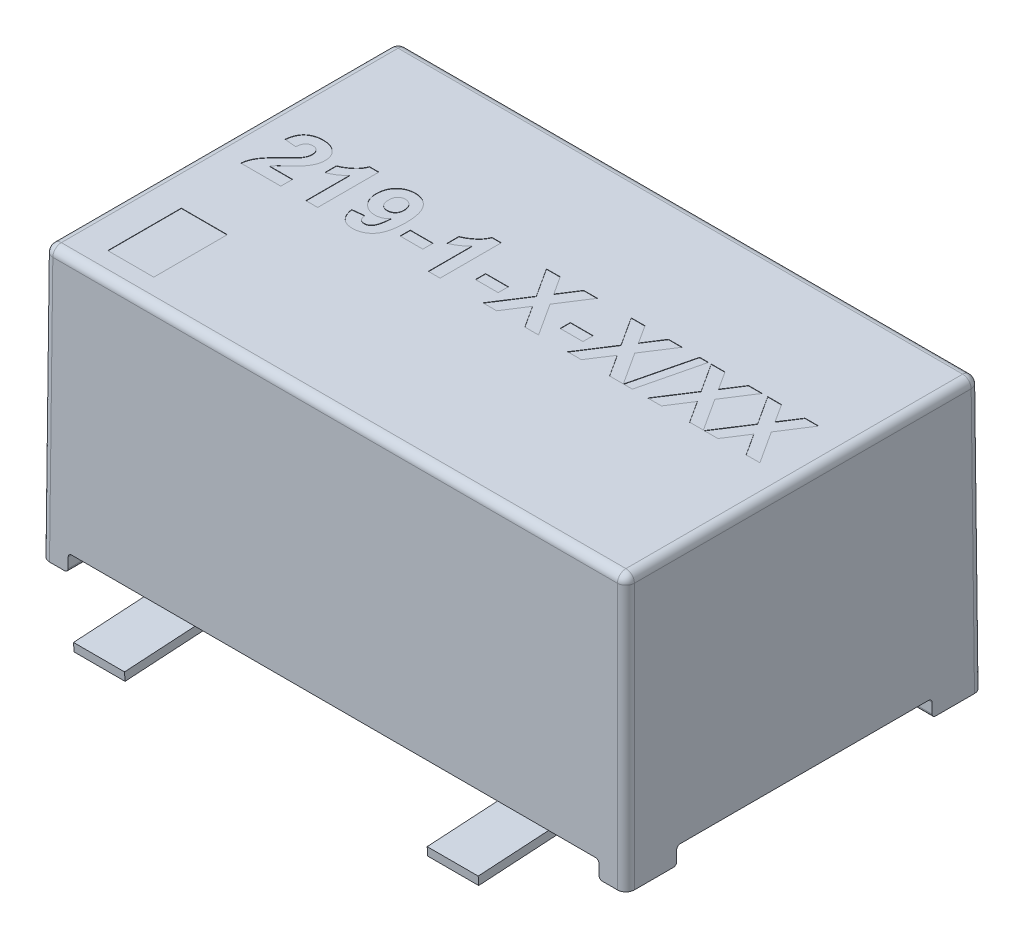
from build123d import *

# Parameters (mm, degrees)
SKETCH1_W                         = 17.2
SKETCH1_H                         = 10.5
MAIN_BODY_DEPTH                   = 7.51
STAND_OFF_FOOT_DEPTH              = 0.5
STAND_OFF_MIRROR2_COPY_1_DEPTH    = 0.5
F_0_36DEG_DRAFT_ANGLE             = -0.36
F_0_25MM_FILLET1_R                = 0.25
F_0_36_INNER_WALL_DRAFT_ANGLE     = 0.36
F_0_36_STAND_OFF_FOOT_DRAFT_ANGLE = 0.36
F_0_20MM_FILLET1_R                = 0.1
SKETCH8_W                         = 1.5
SKETCH8_H                         = 0.25
LPATTERN1_COUNT                   = 2
LPATTERN1_PITCH                   = 4.7
MIRROR2_COPY_1_SKETCH_W           = 1.5
MIRROR2_COPY_1_SKETCH_H           = 0.25
SKETCH9_W                         = 1.5
SKETCH9_H                         = 0.25
SKETCH10_W                        = 1.352618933
SKETCH10_H                        = 2.164190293
SKETCH10_W_2                      = 0.669230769
SKETCH10_H_2                      = 0.3
SKETCH10_W_3                      = 0.66923077
TEXT_2_DEPTH                      = 0.01
SKETCH11_W                        = 1.5
SKETCH11_H                        = 2.987296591
SW2_PINS_REMOVED_DEPTH            = 10


with BuildPart() as part:
    # Sketch1 → Main Body (new body)
    with BuildSketch(Plane(origin=(0, 0, 0), x_dir=(1, 0, 0), z_dir=(0, 1, 0))):
        Rectangle(SKETCH1_W, SKETCH1_H)
    extrude(amount=-MAIN_BODY_DEPTH)

    # Sketch2 → Stand off foot (add)
    with BuildSketch(Plane(origin=(0, -7.51, 0), x_dir=(-1, 0, 0), z_dir=(0, -1, 0))):
        Polygon((-8.6, 5.25), (-7.8, 5.25), (-7.8, 4.75), (-8.1, 4.75), (-8.1, 3.75), (-8.6, 3.75), align=None)
    stand_off_foot = extrude(amount=STAND_OFF_FOOT_DEPTH)

    # Stand off Mirror1: Stand off foot across plane
    add(stand_off_foot.mirror(Plane(origin=(0, 0, 0), x_dir=(0, 0, 1), z_dir=(1, 0, 0))))

    # Stand off Mirror2: Stand off foot across plane
    add(stand_off_foot.mirror(Plane.XY))

    # Stand off Mirror2 copy 1 sketch → Stand off Mirror2 copy 1 (add)
    with BuildSketch(Plane.XZ.offset(7.51)):
        Polygon((-8.6, 5.25), (-7.8, 5.25), (-7.8, 4.75), (-8.1, 4.75), (-8.1, 3.75), (-8.6, 3.75), align=None)
    extrude(amount=STAND_OFF_MIRROR2_COPY_1_DEPTH)

    # 0.36deg Draft
    f_0_36deg_draft_faces = [part.faces().sort_by_distance(p)[0] for p in [
        (-7.8, -7.76, -5),
        (-8.35, -7.76, -3.75),
        (8.35, -7.76, -3.75),
        (7.8, -7.76, -5),
        (8.35, -7.76, 3.75),
        (7.8, -7.76, 5),
        (-8.35, -7.76, 3.75),
        (-7.8, -7.76, 5),
        (-8.6, -3.829761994, 0),
        (0, -3.779651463, 5.25),
        (8.6, -3.829761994, 0),
        (0, -3.779651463, -5.25),
    ]]
    draft(f_0_36deg_draft_faces, Plane(origin=(0, -8.01, 0), x_dir=(0, 0, -1), z_dir=(0, -1, 0)), F_0_36DEG_DRAFT_ANGLE)

    # 0.25mm Fillet1
    f_0_25mm_fillet1_edges = [part.edges().sort_by_distance(p)[0] for p in [
        (0, 0, 5.199671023),
        (-8.549671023, 0, 0),
        (0, 0, -5.199671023),
        (8.549671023, 0, 0),
        (8.574835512, -4.005, 5.224835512),
        (-8.574835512, -4.005, 5.224835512),
        (-8.574835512, -4.005, -5.224835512),
        (8.574835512, -4.005, -5.224835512),
    ]]
    fillet(f_0_25mm_fillet1_edges, radius=F_0_25MM_FILLET1_R)

    # 0.36 Inner Wall Draft
    f_0_36_inner_wall_draft_faces = [part.faces().sort_by_distance(p)[0] for p in [
        (-8.1, -7.760131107, -4.250784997),
        (7.95078403, -7.760438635, -4.75),
        (8.1, -7.760131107, -4.250784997),
        (-7.95078403, -7.760438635, 4.75),
    ]]
    draft(f_0_36_inner_wall_draft_faces, Plane(origin=(0, -7.51, 0), x_dir=(0, 0, -1), z_dir=(0, -1, 0)), F_0_36_INNER_WALL_DRAFT_ANGLE)

    # 0.36 Stand off Foot Draft
    f_0_36_stand_off_foot_draft_faces = [part.faces().sort_by_distance(p)[0] for p in [
        (8.349215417, -7.760262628, 3.751569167),
        (8.35, -7.76, -3.751570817),
        (-8.35, -7.76, -3.751570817),
        (-8.349215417, -7.760262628, 3.751569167),
        (-7.801569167, -7.760262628, -4.999215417),
        (-7.801570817, -7.76, 5),
        (7.801570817, -7.76, -5),
        (7.801569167, -7.760262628, 4.999215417),
    ]]
    draft(f_0_36_stand_off_foot_draft_faces, Plane(origin=(0, -7.51, 0), x_dir=(0, 0, -1), z_dir=(0, -1, 0)), F_0_36_STAND_OFF_FOOT_DRAFT_ANGLE)

    # 0.20mm Fillet1
    f_0_20mm_fillet1_edges = [part.edges().sort_by_distance(p)[0] for p in [
        (8.348429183, -7.51, -3.753141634),
        (7.803141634, -7.51, -4.998429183),
        (8.351570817, -8.01, -3.756283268),
        (7.806283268, -8.01, -5.001570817),
        (-7.806283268, -8.01, -5),
        (-8.351570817, -8.01, -3.756283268),
        (-8.348429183, -7.51, -3.753141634),
        (-7.803141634, -7.51, -4.998429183),
        (-8.348429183, -7.51, 3.753141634),
        (-7.803141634, -7.51, 4.998429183),
        (-8.35, -8.01, 3.756283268),
        (-7.806283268, -8.01, 5.001570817),
        (7.806283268, -8.01, 5),
        (8.35, -8.01, 3.756283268),
        (8.348429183, -7.51, 3.753141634),
        (7.803141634, -7.51, 4.998429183),
    ]]
    fillet(f_0_20mm_fillet1_edges, radius=F_0_20MM_FILLET1_R)

    # Customer Pin 1: sweep along a curve in space
    with BuildLine() as customer_pin_1_path:
        Line((6.8, -7.51, -4.081858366), (6.8, -7.607235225, -4.081858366))
        ThreePointArc((6.8, -7.607235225, -4.081858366), (6.8, -7.864178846, -4.183719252), (6.8, -7.981535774, -4.433965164))
        Line((6.8, -7.981535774, -4.433965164), (6.8, -8.134598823, -6.936523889))
    # Sketch8 → Customer Pin 1 (sweep)
    with BuildSketch(Plane(origin=(0, -7.51, 0), x_dir=(-1, 0, 0), z_dir=(0, -1, 0))):
        with Locations((-6.8, 4.081858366)):
            Rectangle(SKETCH8_W, SKETCH8_H)
    customer_pin_1 = sweep(path=customer_pin_1_path.line)

    # LPattern1: Customer Pin 1 ×2
    with Locations(*[(-i * LPATTERN1_PITCH, 0, 0) for i in range(1, LPATTERN1_COUNT)]):
        add(customer_pin_1)

    # Mirror2: Customer Pin 1 across plane
    add(customer_pin_1.mirror(Plane.ZY))

    # Mirror2 copy 1: sweep along a curve in space
    with BuildLine() as mirror2_copy_1_path:
        Line((-2.1, -7.51, -4.081858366), (-2.1, -7.607235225, -4.081858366))
        ThreePointArc((-2.1, -7.607235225, -4.081858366), (-2.1, -7.864178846, -4.183719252), (-2.1, -7.981535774, -4.433965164))
        Line((-2.1, -7.981535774, -4.433965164), (-2.1, -8.134598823, -6.936523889))
    # Mirror2 copy 1 sketch → Mirror2 copy 1 (sweep)
    with BuildSketch(Plane(origin=(4.7, -7.51, 0), x_dir=(1, 0, 0), z_dir=(0, -1, 0))):
        with Locations((-6.8, -4.081858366)):
            Rectangle(MIRROR2_COPY_1_SKETCH_W, MIRROR2_COPY_1_SKETCH_H)
    sweep(path=mirror2_copy_1_path.line)

    # Customer Pin 2: sweep along a curve in space
    with BuildLine() as customer_pin_2_path:
        Line((5.2, -7.51, 4.081858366), (5.2, -7.607235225, 4.081858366))
        ThreePointArc((5.2, -7.607235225, 4.081858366), (5.2, -7.864178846, 4.183719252), (5.2, -7.981535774, 4.433965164))
        Line((5.2, -7.981535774, 4.433965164), (5.2, -8.134598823, 6.936523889))
    # Sketch9 → Customer Pin 2 (sweep)
    with BuildSketch(Plane.XZ.offset(7.51)):
        with Locations((5.2, 4.081858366)):
            Rectangle(SKETCH9_W, SKETCH9_H)
    customer_pin_2 = sweep(path=customer_pin_2_path.line)

    # Mirror3: Customer Pin 2 across plane
    add(customer_pin_2.mirror(Plane.ZY))

    # Sketch10 → Text 2 (cut)
    # profile 1 of 13: a face of its own
    with BuildSketch(Plane(origin=(0, 0, 0), x_dir=(1, 0, 0), z_dir=(0, 1, 0))):
        with Locations((-6.739224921, -3.389503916)):
            Rectangle(SKETCH10_W, SKETCH10_H)
    # profile 2 of 13: a face of its own
    with BuildSketch(Plane(origin=(0, 0, 0), x_dir=(1, 0, 0), z_dir=(0, 1, 0))):
        with BuildLine():
            Line((-6.512306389, 0.059716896), (-6.512306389, -0.286436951))
            Line((-6.512306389, -0.286436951), (-7.689229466, -0.286436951))
            add(Edge.make_bspline(
                [(-7.689229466, -0.286436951), (-7.685244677, -0.256853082), (-7.677277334, -0.197701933), (-7.652645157, -0.111296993), (-7.619769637, -0.026980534), (-7.584089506, 0.041632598), (-7.548601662, 0.096863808), (-7.51640354, 0.142120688), (-7.477992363, 0.190272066), (-7.433925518, 0.241706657), (-7.384446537, 0.296585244), (-7.329186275, 0.354703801), (-7.267881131, 0.415784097), (-7.224751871, 0.457260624), (-7.20245062, 0.47870728)],
                knots=[0, 0, 0, 0, 1.156289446, 2.311930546, 3.473459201, 4.661751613, 5.303057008, 6.018253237, 6.81459331, 7.690699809, 8.644447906, 9.679642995, 10.800191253, 12, 12, 12, 12], degree=3))
            add(Edge.make_bspline(
                [(-7.20245062, 0.47870728), (-7.184653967, 0.495885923), (-7.15077438, 0.528588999), (-7.102529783, 0.575418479), (-7.060117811, 0.618468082), (-7.022651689, 0.656622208), (-6.990996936, 0.690852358), (-6.964737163, 0.720620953), (-6.943539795, 0.746049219), (-6.932059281, 0.762180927), (-6.926969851, 0.76933228)],
                knots=[0, 0, 0, 0, 1.480720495, 2.818855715, 4.024636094, 5.098235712, 6.019786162, 6.815086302, 7.474715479, 8, 8, 8, 8], degree=3))
            add(Edge.make_bspline(
                [(-6.926969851, 0.76933228), (-6.916547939, 0.786644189), (-6.896445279, 0.820036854), (-6.874401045, 0.872547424), (-6.861169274, 0.925047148), (-6.859353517, 0.960127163), (-6.858460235, 0.977385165)],
                knots=[0, 0, 0, 0, 1.0911822, 2.104764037, 3.067617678, 4, 4, 4, 4], degree=3))
            add(Edge.make_bspline(
                [(-6.858460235, 0.977385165), (-6.859108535, 0.995344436), (-6.860335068, 1.029321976), (-6.870619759, 1.077270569), (-6.888857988, 1.118489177), (-6.913968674, 1.153104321), (-6.945721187, 1.180225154), (-6.982840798, 1.200264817), (-7.025870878, 1.211344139), (-7.056114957, 1.212801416), (-7.071921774, 1.213563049)],
                knots=[0, 0, 0, 0, 1.193122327, 2.257294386, 3.237245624, 4.168877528, 5.075331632, 5.990371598, 6.949684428, 8, 8, 8, 8], degree=3))
            add(Edge.make_bspline(
                [(-7.071921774, 1.213563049), (-7.087621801, 1.212851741), (-7.117950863, 1.211477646), (-7.161055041, 1.19947374), (-7.198763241, 1.178693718), (-7.22563611, 1.155012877), (-7.243790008, 1.13198498), (-7.256159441, 1.111917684), (-7.266820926, 1.089115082), (-7.276267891, 1.063833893), (-7.283729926, 1.035784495), (-7.289739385, 1.005180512), (-7.29458214, 0.97185725), (-7.296122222, 0.948675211), (-7.296921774, 0.936639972)],
                knots=[0, 0, 0, 0, 1.402788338, 2.709884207, 3.961032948, 5.225417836, 5.883680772, 6.578928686, 7.329201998, 8.132101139, 8.990263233, 9.922304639, 10.921339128, 12, 12, 12, 12], degree=3))
            Line((-7.296921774, 0.936639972), (-7.64307562, 0.970534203))
            add(Edge.make_bspline(
                [(-7.64307562, 0.970534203), (-7.640292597, 0.993903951), (-7.634896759, 1.039214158), (-7.621431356, 1.104295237), (-7.604377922, 1.164335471), (-7.582923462, 1.219223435), (-7.557954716, 1.269308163), (-7.528198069, 1.313838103), (-7.49469325, 1.353306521), (-7.457411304, 1.387692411), (-7.416589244, 1.417105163), (-7.373753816, 1.443360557), (-7.328067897, 1.464898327), (-7.280034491, 1.482648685), (-7.229675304, 1.496834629), (-7.176757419, 1.506214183), (-7.121607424, 1.512811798), (-7.083961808, 1.513308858), (-7.064710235, 1.513563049)],
                knots=[0, 0, 0, 0, 1.270971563, 2.464210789, 3.586263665, 4.638946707, 5.643716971, 6.603612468, 7.52484387, 8.434700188, 9.336036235, 10.239171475, 11.145359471, 12.059630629, 13.003312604, 13.96741569, 14.960557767, 16, 16, 16, 16], degree=3))
            add(Edge.make_bspline(
                [(-7.064710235, 1.513563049), (-7.043781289, 1.513160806), (-7.003019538, 1.512377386), (-6.943514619, 1.5059079), (-6.887614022, 1.494627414), (-6.834829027, 1.479684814), (-6.785701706, 1.45973535), (-6.739822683, 1.435617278), (-6.697914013, 1.406415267), (-6.659350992, 1.373721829), (-6.624878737, 1.337769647), (-6.594684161, 1.299420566), (-6.569387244, 1.258701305), (-6.548159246, 1.216108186), (-6.532397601, 1.170955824), (-6.520912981, 1.123868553), (-6.513298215, 1.0746267), (-6.512640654, 1.040995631), (-6.512306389, 1.023899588)],
                knots=[0, 0, 0, 0, 1.210756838, 2.35810096, 3.457354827, 4.507168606, 5.527358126, 6.519769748, 7.499700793, 8.476517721, 9.440526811, 10.376769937, 11.295256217, 12.209626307, 13.124630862, 14.055668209, 15.011616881, 16, 16, 16, 16], degree=3))
            add(Edge.make_bspline(
                [(-6.512306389, 1.023899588), (-6.512746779, 1.004278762), (-6.513620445, 0.965354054), (-6.521985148, 0.907811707), (-6.534764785, 0.851596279), (-6.553652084, 0.796570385), (-6.5775932, 0.741414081), (-6.608453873, 0.686003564), (-6.644285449, 0.628667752), (-6.672340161, 0.591597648), (-6.68682562, 0.57245728)],
                knots=[0, 0, 0, 0, 0.953409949, 1.89141903, 2.821310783, 3.752688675, 4.715703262, 5.740811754, 6.833515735, 8, 8, 8, 8], degree=3))
            add(Edge.make_bspline(
                [(-6.68682562, 0.57245728), (-6.692300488, 0.565561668), (-6.704026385, 0.550792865), (-6.723975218, 0.52814719), (-6.7470942, 0.503410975), (-6.773056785, 0.476121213), (-6.802720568, 0.447244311), (-6.835018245, 0.415572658), (-6.871371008, 0.382726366), (-6.90902366, 0.347886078), (-6.946839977, 0.313976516), (-6.981598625, 0.281769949), (-7.013171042, 0.253274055), (-7.040086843, 0.226915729), (-7.063929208, 0.204493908), (-7.08383878, 0.184858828), (-7.100188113, 0.168485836), (-7.122716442, 0.142964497), (-7.151381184, 0.108446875), (-7.171548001, 0.075464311), (-7.181176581, 0.059716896)],
                knots=[0, 0, 0, 0, 0.665555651, 1.425465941, 2.280616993, 3.225313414, 4.272635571, 5.410053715, 6.644756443, 7.976022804, 9.288331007, 10.484517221, 11.558462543, 12.503158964, 13.33222979, 14.032602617, 14.617328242, 15.080653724, 16.606167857, 18, 18, 18, 18], degree=3))
            Line((-7.181176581, 0.059716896), (-6.512306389, 0.059716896))
        make_face()
    # profile 3 of 13: a face of its own
    with BuildSketch(Plane(origin=(0, 0, 0), x_dir=(1, 0, 0), z_dir=(0, 1, 0))):
        with BuildLine():
            Line((-5.427691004, -0.286436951), (-5.773844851, -0.286436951))
            Line((-5.773844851, -0.286436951), (-5.773844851, 0.995053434))
            add(Edge.make_bspline(
                [(-5.773844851, 0.995053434), (-5.789534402, 0.979125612), (-5.820700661, 0.947486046), (-5.870478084, 0.903353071), (-5.922154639, 0.862297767), (-5.976241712, 0.824710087), (-6.032032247, 0.79005447), (-6.090096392, 0.758604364), (-6.150013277, 0.729924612), (-6.191520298, 0.713897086), (-6.212306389, 0.705870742)],
                knots=[0, 0, 0, 0, 1.012567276, 2.011397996, 3.011400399, 4.000747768, 4.993445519, 5.985067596, 6.990952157, 8, 8, 8, 8], degree=3))
            Line((-6.212306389, 0.705870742), (-6.212306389, 1.052024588))
            add(Edge.make_bspline(
                [(-6.212306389, 1.052024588), (-6.189253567, 1.060668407), (-6.141005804, 1.078759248), (-6.069808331, 1.117239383), (-5.995494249, 1.164881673), (-5.933066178, 1.211607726), (-5.883500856, 1.253150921), (-5.848858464, 1.286545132), (-5.816760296, 1.320742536), (-5.788412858, 1.3568469), (-5.763072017, 1.394128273), (-5.740618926, 1.432525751), (-5.720855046, 1.472160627), (-5.710508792, 1.499761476), (-5.705335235, 1.513563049)],
                knots=[0, 0, 0, 0, 1.253673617, 2.623841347, 4.114270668, 5.751233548, 6.594491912, 7.409089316, 8.202422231, 8.983165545, 9.746111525, 10.498431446, 11.249153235, 12, 12, 12, 12], degree=3))
            Line((-5.705335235, 1.513563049), (-5.427691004, 1.513563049))
            Line((-5.427691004, 1.513563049), (-5.427691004, -0.286436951))
        make_face()
    # profile 4 of 13: a face of its own
    with BuildSketch(Plane(origin=(0, 0, 0), x_dir=(1, 0, 0), z_dir=(0, 1, 0))):
        with BuildLine():
            Line((-4.873844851, 0.15995728), (-4.527691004, 0.198178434))
            add(Edge.make_bspline(
                [(-4.527691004, 0.198178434), (-4.52542437, 0.181605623), (-4.521139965, 0.150279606), (-4.507440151, 0.107293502), (-4.490269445, 0.070394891), (-4.466935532, 0.040701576), (-4.439089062, 0.01803725), (-4.407196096, 0.001682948), (-4.371129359, -0.007737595), (-4.345775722, -0.00890702), (-4.332618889, -0.009513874)],
                knots=[0, 0, 0, 0, 1.261142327, 2.383817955, 3.394783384, 4.319218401, 5.209639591, 6.086630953, 7.00709008, 8, 8, 8, 8], degree=3))
            add(Edge.make_bspline(
                [(-4.332618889, -0.009513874), (-4.324054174, -0.009315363), (-4.307127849, -0.008923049), (-4.282366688, -0.003392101), (-4.258405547, 0.004361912), (-4.235491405, 0.015710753), (-4.213843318, 0.030316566), (-4.192924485, 0.047849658), (-4.17337656, 0.068872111), (-4.153959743, 0.093002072), (-4.136384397, 0.12264467), (-4.120873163, 0.158598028), (-4.106390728, 0.200852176), (-4.094494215, 0.249932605), (-4.083786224, 0.305416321), (-4.074470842, 0.367480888), (-4.066913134, 0.436164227), (-4.063572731, 0.484221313), (-4.06182562, 0.509356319)],
                knots=[0, 0, 0, 0, 0.636702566, 1.258306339, 1.881198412, 2.509855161, 3.155497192, 3.822694, 4.538353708, 5.290656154, 6.125969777, 7.095962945, 8.203044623, 9.449504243, 10.854253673, 12.411741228, 14.12325476, 16, 16, 16, 16], degree=3))
            add(Edge.make_bspline(
                [(-4.06182562, 0.509356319), (-4.072899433, 0.49747065), (-4.094733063, 0.474036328), (-4.130894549, 0.443291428), (-4.16939721, 0.417443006), (-4.21004407, 0.396608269), (-4.252411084, 0.379586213), (-4.297194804, 0.368389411), (-4.343771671, 0.360707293), (-4.375615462, 0.360050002), (-4.391753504, 0.359716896)],
                knots=[0, 0, 0, 0, 1.041520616, 2.053509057, 3.037255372, 4.009786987, 4.979165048, 5.959157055, 6.965725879, 8, 8, 8, 8], degree=3))
            add(Edge.make_bspline(
                [(-4.391753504, 0.359716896), (-4.409444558, 0.360224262), (-4.444374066, 0.361226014), (-4.495760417, 0.368501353), (-4.545271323, 0.380907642), (-4.592985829, 0.398111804), (-4.638662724, 0.420915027), (-4.682884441, 0.447799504), (-4.724702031, 0.48034149), (-4.764725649, 0.516703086), (-4.800718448, 0.557638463), (-4.832863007, 0.601532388), (-4.860063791, 0.64862628), (-4.882003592, 0.698870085), (-4.898971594, 0.751943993), (-4.911307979, 0.807803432), (-4.918516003, 0.866739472), (-4.919497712, 0.90705288), (-4.919998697, 0.927625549)],
                knots=[0, 0, 0, 0, 0.980269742, 1.935460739, 2.869230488, 3.804804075, 4.740187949, 5.694100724, 6.667990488, 7.67211685, 8.68661751, 9.683203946, 10.682901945, 11.694007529, 12.71565541, 13.766145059, 14.860022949, 16, 16, 16, 16], degree=3))
            add(Edge.make_bspline(
                [(-4.919998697, 0.927625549), (-4.919542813, 0.94904508), (-4.918648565, 0.991061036), (-4.910803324, 1.052316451), (-4.898821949, 1.110626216), (-4.880931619, 1.165473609), (-4.858669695, 1.217447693), (-4.830999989, 1.265896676), (-4.798839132, 1.311494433), (-4.761257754, 1.352885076), (-4.720406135, 1.390774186), (-4.676337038, 1.423746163), (-4.629306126, 1.451301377), (-4.579730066, 1.474200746), (-4.527236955, 1.491836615), (-4.472162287, 1.504404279), (-4.414452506, 1.51219689), (-4.375071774, 1.513101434), (-4.354974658, 1.513563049)],
                knots=[0, 0, 0, 0, 1.1238417, 2.204496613, 3.236450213, 4.243990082, 5.227299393, 6.199188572, 7.167261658, 8.150145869, 9.127934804, 10.088143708, 11.032722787, 11.984040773, 12.949643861, 13.93368149, 14.945498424, 16, 16, 16, 16], degree=3))
            add(Edge.make_bspline(
                [(-4.354974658, 1.513563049), (-4.333064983, 1.512957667), (-4.290102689, 1.511770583), (-4.227136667, 1.501885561), (-4.167391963, 1.485067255), (-4.11027493, 1.462514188), (-4.05660884, 1.432467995), (-4.005695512, 1.396204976), (-3.958215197, 1.352984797), (-3.913336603, 1.303663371), (-3.872504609, 1.246672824), (-3.837740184, 1.180806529), (-3.80816922, 1.106688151), (-3.784300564, 1.024158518), (-3.765650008, 0.93323879), (-3.752777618, 0.833930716), (-3.744164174, 0.726214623), (-3.743447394, 0.651562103), (-3.74307562, 0.612841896)],
                knots=[0, 0, 0, 0, 0.854852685, 1.67626545, 2.479841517, 3.273455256, 4.067207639, 4.874322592, 5.708061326, 6.568303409, 7.473035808, 8.43640186, 9.467839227, 10.582672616, 11.785182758, 13.086903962, 14.489057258, 16, 16, 16, 16], degree=3))
            add(Edge.make_bspline(
                [(-3.74307562, 0.612841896), (-3.743612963, 0.573522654), (-3.744651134, 0.497556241), (-3.75302774, 0.387888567), (-3.766286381, 0.286627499), (-3.785780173, 0.193953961), (-3.81024355, 0.109534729), (-3.841004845, 0.033691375), (-3.876831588, -0.033967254), (-3.918771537, -0.092818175), (-3.964878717, -0.143966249), (-4.014435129, -0.188277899), (-4.067511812, -0.225619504), (-4.123648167, -0.256767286), (-4.183683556, -0.280092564), (-4.246787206, -0.296991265), (-4.31312887, -0.307938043), (-4.358536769, -0.30898221), (-4.381657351, -0.309513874)],
                knots=[0, 0, 0, 0, 1.487495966, 2.873904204, 4.158892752, 5.348685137, 6.453750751, 7.479786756, 8.440129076, 9.343583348, 10.206541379, 11.040779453, 11.853317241, 12.65721927, 13.463689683, 14.283322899, 15.125910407, 16, 16, 16, 16], degree=3))
            add(Edge.make_bspline(
                [(-4.381657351, -0.309513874), (-4.398257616, -0.309172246), (-4.430828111, -0.308501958), (-4.478513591, -0.303109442), (-4.523761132, -0.293738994), (-4.566420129, -0.280652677), (-4.606823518, -0.264560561), (-4.644628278, -0.244145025), (-4.679844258, -0.219872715), (-4.713071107, -0.192489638), (-4.742974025, -0.160748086), (-4.77048115, -0.125703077), (-4.795156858, -0.087003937), (-4.816172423, -0.044318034), (-4.835571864, 0.001364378), (-4.851198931, 0.051055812), (-4.864232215, 0.104195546), (-4.870584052, 0.14104178), (-4.873844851, 0.15995728)],
                knots=[0, 0, 0, 0, 1.056675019, 2.073245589, 3.050223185, 3.994251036, 4.910773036, 5.814621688, 6.723026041, 7.630269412, 8.550362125, 9.493303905, 10.463425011, 11.466105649, 12.519144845, 13.620215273, 14.778306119, 16, 16, 16, 16], degree=3))
        make_face()
        with BuildLine():
            add(Edge.make_bspline(
                [(-4.089229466, 0.918971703), (-4.089356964, 0.930404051), (-4.089604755, 0.952622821), (-4.093818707, 0.984799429), (-4.099932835, 1.014930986), (-4.108030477, 1.043351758), (-4.119336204, 1.069591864), (-4.132745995, 1.094064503), (-4.14859124, 1.116573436), (-4.172984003, 1.142868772), (-4.206095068, 1.171173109), (-4.250450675, 1.195758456), (-4.298091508, 1.211087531), (-4.331063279, 1.212730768), (-4.34776312, 1.213563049)],
                knots=[0, 0, 0, 0, 0.937516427, 1.822063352, 2.657744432, 3.45986214, 4.242145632, 4.997087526, 5.746986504, 6.494090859, 7.936347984, 9.300605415, 10.632786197, 12, 12, 12, 12], degree=3))
            add(Edge.make_bspline(
                [(-4.34776312, 1.213563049), (-4.363351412, 1.212856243), (-4.393692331, 1.211480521), (-4.437116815, 1.199116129), (-4.476454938, 1.179048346), (-4.505108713, 1.155636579), (-4.52552873, 1.133306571), (-4.538327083, 1.113303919), (-4.549224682, 1.09100809), (-4.558247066, 1.06622899), (-4.5653663, 1.03895319), (-4.570413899, 1.009035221), (-4.573161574, 0.97671601), (-4.573612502, 0.954313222), (-4.573844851, 0.94276978)],
                knots=[0, 0, 0, 0, 1.397188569, 2.719475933, 4.017809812, 5.337496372, 6.01771949, 6.727108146, 7.460709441, 8.242571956, 9.09066939, 9.98839818, 10.963485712, 12, 12, 12, 12], degree=3))
            add(Edge.make_bspline(
                [(-4.573844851, 0.94276978), (-4.573658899, 0.93098146), (-4.573299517, 0.908198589), (-4.569928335, 0.875192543), (-4.564870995, 0.844567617), (-4.556655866, 0.816562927), (-4.547003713, 0.79077981), (-4.535348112, 0.767139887), (-4.520546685, 0.746516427), (-4.499165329, 0.72205473), (-4.467883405, 0.69715436), (-4.425468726, 0.675442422), (-4.378612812, 0.662019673), (-4.345809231, 0.660496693), (-4.32901312, 0.659716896)],
                knots=[0, 0, 0, 0, 1.000122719, 1.932902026, 2.813346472, 3.630219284, 4.405058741, 5.14865055, 5.858963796, 6.55275156, 7.902081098, 9.220520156, 10.576848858, 12, 12, 12, 12], degree=3))
            add(Edge.make_bspline(
                [(-4.32901312, 0.659716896), (-4.312690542, 0.660356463), (-4.28084105, 0.661604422), (-4.235527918, 0.674933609), (-4.193930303, 0.69537909), (-4.163496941, 0.719509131), (-4.141740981, 0.742363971), (-4.127738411, 0.761991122), (-4.115667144, 0.783472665), (-4.106027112, 0.806999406), (-4.098445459, 0.832367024), (-4.093106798, 0.85953407), (-4.089791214, 0.888600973), (-4.089420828, 0.908625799), (-4.089229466, 0.918971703)],
                knots=[0, 0, 0, 0, 1.470045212, 2.868431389, 4.227473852, 5.634383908, 6.348475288, 7.071419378, 7.805118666, 8.569021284, 9.362200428, 10.192314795, 11.06605236, 12, 12, 12, 12], degree=3))
        make_face(mode=Mode.SUBTRACT)
    # profile 5 of 13: a face of its own
    with BuildSketch(Plane(origin=(0, 0, 0), x_dir=(1, 0, 0), z_dir=(0, 1, 0))):
        with Locations((-3.154614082, 0.348178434)):
            Rectangle(SKETCH10_W_2, SKETCH10_H_2)
    # profile 6 of 13: a face of its own
    with BuildSketch(Plane(origin=(0, 0, 0), x_dir=(1, 0, 0), z_dir=(0, 1, 0))):
        with BuildLine():
            Line((-1.827691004, -0.286436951), (-2.173844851, -0.286436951))
            Line((-2.173844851, -0.286436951), (-2.173844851, 0.995053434))
            add(Edge.make_bspline(
                [(-2.173844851, 0.995053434), (-2.189534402, 0.979125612), (-2.220700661, 0.947486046), (-2.270478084, 0.903353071), (-2.322154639, 0.862297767), (-2.376241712, 0.824710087), (-2.432032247, 0.79005447), (-2.490096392, 0.758604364), (-2.550013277, 0.729924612), (-2.591520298, 0.713897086), (-2.612306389, 0.705870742)],
                knots=[0, 0, 0, 0, 1.012567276, 2.011397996, 3.011400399, 4.000747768, 4.993445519, 5.985067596, 6.990952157, 8, 8, 8, 8], degree=3))
            Line((-2.612306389, 0.705870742), (-2.612306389, 1.052024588))
            add(Edge.make_bspline(
                [(-2.612306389, 1.052024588), (-2.589253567, 1.060668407), (-2.541005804, 1.078759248), (-2.469808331, 1.117239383), (-2.395494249, 1.164881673), (-2.333066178, 1.211607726), (-2.283500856, 1.253150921), (-2.248858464, 1.286545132), (-2.216760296, 1.320742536), (-2.188412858, 1.3568469), (-2.163072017, 1.394128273), (-2.140618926, 1.432525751), (-2.120855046, 1.472160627), (-2.110508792, 1.499761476), (-2.105335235, 1.513563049)],
                knots=[0, 0, 0, 0, 1.253673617, 2.623841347, 4.114270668, 5.751233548, 6.594491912, 7.409089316, 8.202422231, 8.983165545, 9.746111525, 10.498431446, 11.249153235, 12, 12, 12, 12], degree=3))
            Line((-2.105335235, 1.513563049), (-1.827691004, 1.513563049))
            Line((-1.827691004, 1.513563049), (-1.827691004, -0.286436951))
        make_face()
    # profile 7 of 13: a face of its own
    with BuildSketch(Plane(origin=(0, 0, 0), x_dir=(1, 0, 0), z_dir=(0, 1, 0))):
        with Locations((-0.939229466, 0.348178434)):
            Rectangle(SKETCH10_W_3, SKETCH10_H_2)
    # profile 8 of 13: a face of its own
    with BuildSketch(Plane(origin=(0, 0, 0), x_dir=(1, 0, 0), z_dir=(0, 1, 0))):
        Polygon((-0.569998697, -0.286436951), (0.046948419, 0.666928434), (-0.500767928, 1.513563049), (-0.09620062, 1.513563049), (0.249232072, 0.979548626), (0.594664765, 1.513563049), (0.999232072, 1.513563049), (0.451515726, 0.666928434), (1.068462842, -0.286436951), (0.663895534, -0.286436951), (0.249232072, 0.354308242), (-0.165431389, -0.286436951), align=None)
    # profile 9 of 13: a face of its own
    with BuildSketch(Plane(origin=(0, 0, 0), x_dir=(1, 0, 0), z_dir=(0, 1, 0))):
        with Locations((1.553078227, 0.348178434)):
            Rectangle(SKETCH10_W_2, SKETCH10_H_2)
    # profile 10 of 13: a face of its own
    with BuildSketch(Plane(origin=(0, 0, 0), x_dir=(1, 0, 0), z_dir=(0, 1, 0))):
        Polygon((1.922308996, -0.286436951), (2.539256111, 0.666928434), (1.991539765, 1.513563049), (2.396107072, 1.513563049), (2.741539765, 0.979548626), (3.086972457, 1.513563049), (3.491539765, 1.513563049), (2.943823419, 0.666928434), (3.560770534, -0.286436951), (3.156203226, -0.286436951), (2.741539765, 0.354308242), (2.326876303, -0.286436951), align=None)
    # profile 11 of 13: a face of its own
    with BuildSketch(Plane(origin=(0, 0, 0), x_dir=(1, 0, 0), z_dir=(0, 1, 0))):
        Polygon((3.565097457, -0.286436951), (4.003919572, 1.513563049), (4.264616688, 1.513563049), (3.826155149, -0.286436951), align=None)
    # profile 12 of 13: a face of its own
    with BuildSketch(Plane(origin=(0, 0, 0), x_dir=(1, 0, 0), z_dir=(0, 1, 0))):
        Polygon((4.276155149, -0.286436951), (4.893102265, 0.666928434), (4.345385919, 1.513563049), (4.749953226, 1.513563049), (5.095385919, 0.979548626), (5.440818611, 1.513563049), (5.845385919, 1.513563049), (5.297669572, 0.666928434), (5.914616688, -0.286436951), (5.51004938, -0.286436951), (5.095385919, 0.354308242), (4.680722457, -0.286436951), align=None)
    # profile 13 of 13: a face of its own
    with BuildSketch(Plane(origin=(0, 0, 0), x_dir=(1, 0, 0), z_dir=(0, 1, 0))):
        Polygon((5.937693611, -0.286436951), (6.554640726, 0.666928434), (6.00692438, 1.513563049), (6.411491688, 1.513563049), (6.75692438, 0.979548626), (7.102357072, 1.513563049), (7.50692438, 1.513563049), (6.959208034, 0.666928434), (7.576155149, -0.286436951), (7.171587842, -0.286436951), (6.75692438, 0.354308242), (6.342260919, -0.286436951), align=None)
    extrude(amount=-TEXT_2_DEPTH, mode=Mode.SUBTRACT)

    # Sketch11 → SW2 Pins Removed (cut)
    with BuildSketch(Plane.XZ.offset(7.51)):
        with Locations((6.8, -5.450506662)):
            Rectangle(SKETCH11_W, SKETCH11_H)
        with Locations((-6.8, -5.450506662)):
            Rectangle(SKETCH11_W, SKETCH11_H)
    extrude(amount=SW2_PINS_REMOVED_DEPTH, mode=Mode.SUBTRACT)


solid = part.part
